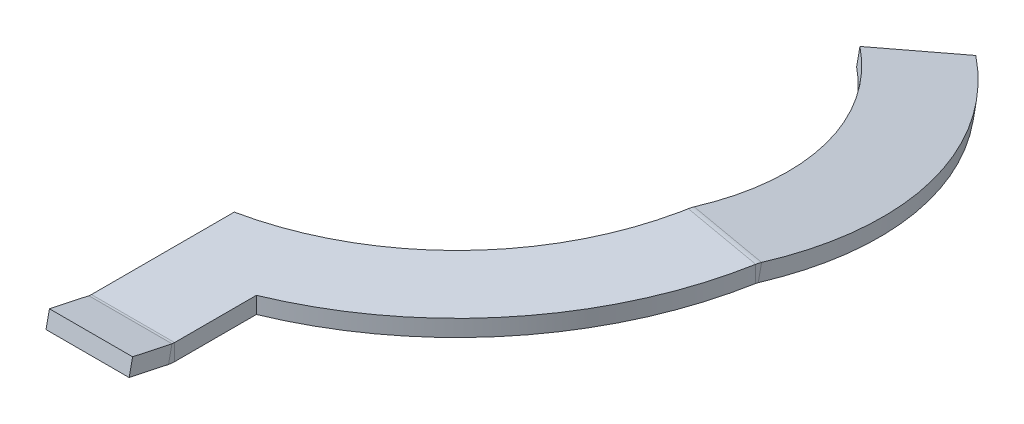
ISO-10303-21;
HEADER;
FILE_DESCRIPTION(('STEP AP214'),'2;1');
FILE_NAME('part.step','',(''),(''),'','','');
FILE_SCHEMA(('AUTOMOTIVE_DESIGN { 1 0 10303 214 1 1 1 1 }'));
ENDSEC;
DATA;
#1=APPLICATION_CONTEXT('core data for automotive mechanical design processes');
#2=APPLICATION_PROTOCOL_DEFINITION('international standard','automotive_design',2000,#1);
#3=PRODUCT_CONTEXT('',#1,'mechanical');
#4=PRODUCT('Part','Part','',(#3));
#5=PRODUCT_RELATED_PRODUCT_CATEGORY('part','',(#4));
#6=PRODUCT_DEFINITION_FORMATION('','',#4);
#7=PRODUCT_DEFINITION_CONTEXT('part definition',#1,'design');
#8=PRODUCT_DEFINITION('design','',#6,#7);
#9=PRODUCT_DEFINITION_SHAPE('','',#8);
#10=(LENGTH_UNIT() NAMED_UNIT(*) SI_UNIT(.MILLI.,.METRE.));
#11=(NAMED_UNIT(*) PLANE_ANGLE_UNIT() SI_UNIT($,.RADIAN.));
#12=(NAMED_UNIT(*) SI_UNIT($,.STERADIAN.) SOLID_ANGLE_UNIT());
#13=UNCERTAINTY_MEASURE_WITH_UNIT(LENGTH_MEASURE(1.E-05),#10,'distance_accuracy_value','');
#14=(GEOMETRIC_REPRESENTATION_CONTEXT(3) GLOBAL_UNCERTAINTY_ASSIGNED_CONTEXT((#13)) GLOBAL_UNIT_ASSIGNED_CONTEXT((#10,
#11,#12)) REPRESENTATION_CONTEXT('',''));
#15=CARTESIAN_POINT('',(0.,0.,0.));
#16=DIRECTION('',(0.,0.,1.));
#17=DIRECTION('',(1.,0.,0.));
#18=AXIS2_PLACEMENT_3D('',#15,#16,#17);
#19=CARTESIAN_POINT('',(0.,4.,0.));
#20=DIRECTION('',(0.,1.,0.));
#21=DIRECTION('',(0.,0.,1.));
#22=AXIS2_PLACEMENT_3D('',#19,#20,#21);
#23=PLANE('',#22);
#24=CARTESIAN_POINT('',(0.,4.,0.));
#25=DIRECTION('',(0.,1.,0.));
#26=DIRECTION('',(0.,0.,1.));
#27=AXIS2_PLACEMENT_3D('',#24,#25,#26);
#28=CIRCLE('',#27,89.);
#29=CARTESIAN_POINT('',(34.,4.,82.2496200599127));
#30=VERTEX_POINT('',#29);
#31=CARTESIAN_POINT('',(87.6019321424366,3.99999999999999,15.7130991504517));
#32=VERTEX_POINT('',#31);
#33=EDGE_CURVE('E306',#30,#32,#28,.T.);
#34=ORIENTED_EDGE('',*,*,#33,.T.);
#35=DIRECTION('',(0.984807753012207,0.,0.173648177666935));
#36=VECTOR('',#35,1.);
#37=CARTESIAN_POINT('',(87.6019321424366,3.99999999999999,15.7130991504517));
#38=LINE('',#37,#36);
#39=CARTESIAN_POINT('',(67.9061582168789,4.,12.2402028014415));
#40=VERTEX_POINT('',#39);
#41=EDGE_CURVE('E184',#32,#40,#38,.F.);
#42=ORIENTED_EDGE('',*,*,#41,.T.);
#43=DIRECTION('',(-0.173648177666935,0.,0.984807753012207));
#44=VECTOR('',#43,1.);
#45=CARTESIAN_POINT('',(67.9517349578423,4.,11.9817242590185));
#46=LINE('',#45,#44);
#47=CARTESIAN_POINT('',(67.5588618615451,4.,14.2098183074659));
#48=VERTEX_POINT('',#47);
#49=EDGE_CURVE('E54',#40,#48,#46,.T.);
#50=ORIENTED_EDGE('',*,*,#49,.T.);
#51=DIRECTION('',(-0.984807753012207,0.,-0.173648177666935));
#52=VECTOR('',#51,1.);
#53=CARTESIAN_POINT('',(-0.392873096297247,4.,2.22809404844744));
#54=LINE('',#53,#52);
#55=CARTESIAN_POINT('',(67.5223231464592,4.,14.2033755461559));
#56=VERTEX_POINT('',#55);
#57=EDGE_CURVE('E229',#48,#56,#54,.T.);
#58=ORIENTED_EDGE('',*,*,#57,.T.);
#59=CARTESIAN_POINT('',(0.,4.,0.));
#60=DIRECTION('',(0.,-1.,0.));
#61=DIRECTION('',(0.,0.,1.));
#62=AXIS2_PLACEMENT_3D('',#59,#60,#61);
#63=CIRCLE('',#62,69.);
#64=CARTESIAN_POINT('',(14.,4.,67.5647837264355));
#65=VERTEX_POINT('',#64);
#66=EDGE_CURVE('E309',#56,#65,#63,.T.);
#67=ORIENTED_EDGE('',*,*,#66,.T.);
#68=DIRECTION('',(0.,0.,1.));
#69=VECTOR('',#68,1.);
#70=CARTESIAN_POINT('',(14.,4.,102.249620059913));
#71=LINE('',#70,#69);
#72=CARTESIAN_POINT('',(14.,4.,101.934307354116));
#73=VERTEX_POINT('',#72);
#74=EDGE_CURVE('E301',#65,#73,#71,.T.);
#75=ORIENTED_EDGE('',*,*,#74,.T.);
#76=DIRECTION('',(1.,0.,0.));
#77=VECTOR('',#76,1.);
#78=CARTESIAN_POINT('',(34.,4.,101.934307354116));
#79=LINE('',#78,#77);
#80=CARTESIAN_POINT('',(34.,4.,101.934307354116));
#81=VERTEX_POINT('',#80);
#82=EDGE_CURVE('E274',#81,#73,#79,.F.);
#83=ORIENTED_EDGE('',*,*,#82,.F.);
#84=DIRECTION('',(0.,0.,-1.));
#85=VECTOR('',#84,1.);
#86=CARTESIAN_POINT('',(34.,4.,102.249620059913));
#87=LINE('',#86,#85);
#88=EDGE_CURVE('E304',#81,#30,#87,.T.);
#89=ORIENTED_EDGE('',*,*,#88,.T.);
#90=EDGE_LOOP('',(#34,#42,#50,#58,#67,#75,#83,#89));
#91=FACE_BOUND('',#90,.T.);
#92=ADVANCED_FACE('F31',(#91),#23,.T.);
#93=CARTESIAN_POINT('',(0.,0.,0.));
#94=DIRECTION('',(0.,1.,0.));
#95=DIRECTION('',(0.,0.,1.));
#96=AXIS2_PLACEMENT_3D('',#93,#94,#95);
#97=PLANE('',#96);
#98=DIRECTION('',(0.984807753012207,0.,0.173648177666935));
#99=VECTOR('',#98,1.);
#100=CARTESIAN_POINT('',(87.6019321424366,0.,15.7130991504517));
#101=LINE('',#100,#99);
#102=CARTESIAN_POINT('',(87.6019321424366,0.,15.7130991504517));
#103=VERTEX_POINT('',#102);
#104=CARTESIAN_POINT('',(67.9061582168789,0.,12.2402028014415));
#105=VERTEX_POINT('',#104);
#106=EDGE_CURVE('E175',#103,#105,#101,.F.);
#107=ORIENTED_EDGE('',*,*,#106,.F.);
#108=CARTESIAN_POINT('',(0.,0.,0.));
#109=DIRECTION('',(0.,1.,0.));
#110=DIRECTION('',(0.,0.,1.));
#111=AXIS2_PLACEMENT_3D('',#108,#109,#110);
#112=CIRCLE('',#111,89.);
#113=CARTESIAN_POINT('',(34.,0.,82.2496200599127));
#114=VERTEX_POINT('',#113);
#115=EDGE_CURVE('E296',#114,#103,#112,.T.);
#116=ORIENTED_EDGE('',*,*,#115,.F.);
#117=DIRECTION('',(0.,0.,-1.));
#118=VECTOR('',#117,1.);
#119=CARTESIAN_POINT('',(34.,0.,102.249620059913));
#120=LINE('',#119,#118);
#121=CARTESIAN_POINT('',(34.,0.,101.934307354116));
#122=VERTEX_POINT('',#121);
#123=EDGE_CURVE('E294',#122,#114,#120,.T.);
#124=ORIENTED_EDGE('',*,*,#123,.F.);
#125=DIRECTION('',(1.,0.,0.));
#126=VECTOR('',#125,1.);
#127=CARTESIAN_POINT('',(34.,0.,101.934307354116));
#128=LINE('',#127,#126);
#129=CARTESIAN_POINT('',(14.,0.,101.934307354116));
#130=VERTEX_POINT('',#129);
#131=EDGE_CURVE('E279',#122,#130,#128,.F.);
#132=ORIENTED_EDGE('',*,*,#131,.T.);
#133=DIRECTION('',(0.,0.,1.));
#134=VECTOR('',#133,1.);
#135=CARTESIAN_POINT('',(14.,0.,102.249620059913));
#136=LINE('',#135,#134);
#137=CARTESIAN_POINT('',(14.,0.,67.5647837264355));
#138=VERTEX_POINT('',#137);
#139=EDGE_CURVE('E290',#138,#130,#136,.T.);
#140=ORIENTED_EDGE('',*,*,#139,.F.);
#141=CARTESIAN_POINT('',(0.,0.,0.));
#142=DIRECTION('',(0.,-1.,0.));
#143=DIRECTION('',(0.,0.,1.));
#144=AXIS2_PLACEMENT_3D('',#141,#142,#143);
#145=CIRCLE('',#144,69.);
#146=CARTESIAN_POINT('',(67.5223231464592,0.,14.2033755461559));
#147=VERTEX_POINT('',#146);
#148=EDGE_CURVE('E299',#147,#138,#145,.T.);
#149=ORIENTED_EDGE('',*,*,#148,.F.);
#150=DIRECTION('',(-0.984807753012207,0.,-0.173648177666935));
#151=VECTOR('',#150,1.);
#152=CARTESIAN_POINT('',(67.5588618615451,0.,14.2098183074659));
#153=LINE('',#152,#151);
#154=CARTESIAN_POINT('',(67.5588618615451,0.,14.2098183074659));
#155=VERTEX_POINT('',#154);
#156=EDGE_CURVE('E230',#155,#147,#153,.T.);
#157=ORIENTED_EDGE('',*,*,#156,.F.);
#158=DIRECTION('',(-0.173648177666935,0.,0.984807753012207));
#159=VECTOR('',#158,1.);
#160=CARTESIAN_POINT('',(67.9061582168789,0.,12.2402028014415));
#161=LINE('',#160,#159);
#162=EDGE_CURVE('E226',#105,#155,#161,.T.);
#163=ORIENTED_EDGE('',*,*,#162,.F.);
#164=EDGE_LOOP('',(#107,#116,#124,#132,#140,#149,#157,#163));
#165=FACE_BOUND('',#164,.T.);
#166=ADVANCED_FACE('F324',(#165),#97,.F.);
#167=CARTESIAN_POINT('',(0.,4.,0.));
#168=DIRECTION('',(0.,-1.,0.));
#169=DIRECTION('',(0.,0.,-1.));
#170=AXIS2_PLACEMENT_3D('',#167,#168,#169);
#171=CYLINDRICAL_SURFACE('',#170,89.);
#172=DIRECTION('',(0.,1.,0.));
#173=VECTOR('',#172,1.);
#174=CARTESIAN_POINT('',(87.6019321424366,0.,15.7130991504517));
#175=LINE('',#174,#173);
#176=EDGE_CURVE('E215',#103,#32,#175,.T.);
#177=ORIENTED_EDGE('',*,*,#176,.T.);
#178=ORIENTED_EDGE('',*,*,#33,.F.);
#179=DIRECTION('',(0.,-1.,0.));
#180=VECTOR('',#179,1.);
#181=CARTESIAN_POINT('',(34.,4.,82.2496200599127));
#182=LINE('',#181,#180);
#183=EDGE_CURVE('E39',#30,#114,#182,.T.);
#184=ORIENTED_EDGE('',*,*,#183,.T.);
#185=ORIENTED_EDGE('',*,*,#115,.T.);
#186=EDGE_LOOP('',(#177,#178,#184,#185));
#187=FACE_BOUND('',#186,.T.);
#188=ADVANCED_FACE('F318',(#187),#171,.T.);
#189=CARTESIAN_POINT('',(0.,4.,0.));
#190=DIRECTION('',(0.,-1.,0.));
#191=DIRECTION('',(0.,0.,-1.));
#192=AXIS2_PLACEMENT_3D('',#189,#190,#191);
#193=CYLINDRICAL_SURFACE('',#192,69.);
#194=DIRECTION('',(0.,-1.,0.));
#195=VECTOR('',#194,1.);
#196=CARTESIAN_POINT('',(67.5223231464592,4.,14.2033755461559));
#197=LINE('',#196,#195);
#198=EDGE_CURVE('E11',#147,#56,#197,.F.);
#199=ORIENTED_EDGE('',*,*,#198,.F.);
#200=ORIENTED_EDGE('',*,*,#148,.T.);
#201=DIRECTION('',(0.,-1.,0.));
#202=VECTOR('',#201,1.);
#203=CARTESIAN_POINT('',(14.,4.,67.5647837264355));
#204=LINE('',#203,#202);
#205=EDGE_CURVE('E311',#65,#138,#204,.T.);
#206=ORIENTED_EDGE('',*,*,#205,.F.);
#207=ORIENTED_EDGE('',*,*,#66,.F.);
#208=EDGE_LOOP('',(#199,#200,#206,#207));
#209=FACE_BOUND('',#208,.T.);
#210=ADVANCED_FACE('F365',(#209),#193,.F.);
#211=CARTESIAN_POINT('',(14.,4.,102.249620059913));
#212=DIRECTION('',(1.,0.,0.));
#213=DIRECTION('',(0.,0.,-1.));
#214=AXIS2_PLACEMENT_3D('',#211,#212,#213);
#215=PLANE('',#214);
#216=DIRECTION('',(0.,-1.,0.));
#217=VECTOR('',#216,1.);
#218=CARTESIAN_POINT('',(14.,4.,101.934307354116));
#219=LINE('',#218,#217);
#220=EDGE_CURVE('E287',#73,#130,#219,.T.);
#221=ORIENTED_EDGE('',*,*,#220,.F.);
#222=ORIENTED_EDGE('',*,*,#74,.F.);
#223=ORIENTED_EDGE('',*,*,#205,.T.);
#224=ORIENTED_EDGE('',*,*,#139,.T.);
#225=EDGE_LOOP('',(#221,#222,#223,#224));
#226=FACE_BOUND('',#225,.T.);
#227=ADVANCED_FACE('F33',(#226),#215,.F.);
#228=CARTESIAN_POINT('',(34.,4.,102.249620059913));
#229=DIRECTION('',(-1.,0.,0.));
#230=DIRECTION('',(0.,0.,1.));
#231=AXIS2_PLACEMENT_3D('',#228,#229,#230);
#232=PLANE('',#231);
#233=DIRECTION('',(0.,-1.,0.));
#234=VECTOR('',#233,1.);
#235=CARTESIAN_POINT('',(34.,4.,101.934307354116));
#236=LINE('',#235,#234);
#237=EDGE_CURVE('E284',#81,#122,#236,.T.);
#238=ORIENTED_EDGE('',*,*,#237,.T.);
#239=ORIENTED_EDGE('',*,*,#123,.T.);
#240=ORIENTED_EDGE('',*,*,#183,.F.);
#241=ORIENTED_EDGE('',*,*,#88,.F.);
#242=EDGE_LOOP('',(#238,#239,#240,#241));
#243=FACE_BOUND('',#242,.T.);
#244=ADVANCED_FACE('F370',(#243),#232,.F.);
#245=CARTESIAN_POINT('',(14.,6.99999999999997,101.934307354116));
#246=DIRECTION('',(-1.,0.,0.));
#247=DIRECTION('',(0.,-1.,0.));
#248=AXIS2_PLACEMENT_3D('',#245,#246,#247);
#249=PLANE('',#248);
#250=DIRECTION('',(0.,-0.978147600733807,0.207911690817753));
#251=VECTOR('',#250,1.);
#252=CARTESIAN_POINT('',(14.,4.06555719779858,102.558042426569));
#253=LINE('',#252,#251);
#254=CARTESIAN_POINT('',(14.,4.06555719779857,102.558042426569));
#255=VERTEX_POINT('',#254);
#256=CARTESIAN_POINT('',(14.,0.152966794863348,103.38968918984));
#257=VERTEX_POINT('',#256);
#258=EDGE_CURVE('E237',#255,#257,#253,.T.);
#259=ORIENTED_EDGE('',*,*,#258,.F.);
#260=CARTESIAN_POINT('',(14.,6.99999999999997,101.934307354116));
#261=DIRECTION('',(1.,0.,0.));
#262=DIRECTION('',(0.,1.,0.));
#263=AXIS2_PLACEMENT_3D('',#260,#261,#262);
#264=CIRCLE('',#263,2.99999999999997);
#265=EDGE_CURVE('E270',#73,#255,#264,.F.);
#266=ORIENTED_EDGE('',*,*,#265,.F.);
#267=ORIENTED_EDGE('',*,*,#220,.T.);
#268=CARTESIAN_POINT('',(14.,6.99999999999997,101.934307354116));
#269=DIRECTION('',(1.,0.,0.));
#270=DIRECTION('',(0.,1.,0.));
#271=AXIS2_PLACEMENT_3D('',#268,#269,#270);
#272=CIRCLE('',#271,6.99999999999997);
#273=EDGE_CURVE('E281',#130,#257,#272,.F.);
#274=ORIENTED_EDGE('',*,*,#273,.T.);
#275=EDGE_LOOP('',(#259,#266,#267,#274));
#276=FACE_BOUND('',#275,.T.);
#277=ADVANCED_FACE('F372',(#276),#249,.T.);
#278=CARTESIAN_POINT('',(34.,6.99999999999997,101.934307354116));
#279=DIRECTION('',(-1.,0.,0.));
#280=DIRECTION('',(0.,-1.,0.));
#281=AXIS2_PLACEMENT_3D('',#278,#279,#280);
#282=PLANE('',#281);
#283=CARTESIAN_POINT('',(34.,6.99999999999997,101.934307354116));
#284=DIRECTION('',(1.,0.,0.));
#285=DIRECTION('',(0.,1.,0.));
#286=AXIS2_PLACEMENT_3D('',#283,#284,#285);
#287=CIRCLE('',#286,2.99999999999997);
#288=CARTESIAN_POINT('',(34.,4.06555719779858,102.558042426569));
#289=VERTEX_POINT('',#288);
#290=EDGE_CURVE('E267',#289,#81,#287,.T.);
#291=ORIENTED_EDGE('',*,*,#290,.F.);
#292=DIRECTION('',(0.,-0.978147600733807,0.207911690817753));
#293=VECTOR('',#292,1.);
#294=CARTESIAN_POINT('',(34.,4.06555719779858,102.558042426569));
#295=LINE('',#294,#293);
#296=CARTESIAN_POINT('',(34.,0.152966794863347,103.38968918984));
#297=VERTEX_POINT('',#296);
#298=EDGE_CURVE('E240',#289,#297,#295,.T.);
#299=ORIENTED_EDGE('',*,*,#298,.T.);
#300=CARTESIAN_POINT('',(34.,6.99999999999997,101.934307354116));
#301=DIRECTION('',(1.,0.,0.));
#302=DIRECTION('',(0.,1.,0.));
#303=AXIS2_PLACEMENT_3D('',#300,#301,#302);
#304=CIRCLE('',#303,6.99999999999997);
#305=EDGE_CURVE('E273',#297,#122,#304,.T.);
#306=ORIENTED_EDGE('',*,*,#305,.T.);
#307=ORIENTED_EDGE('',*,*,#237,.F.);
#308=EDGE_LOOP('',(#291,#299,#306,#307));
#309=FACE_BOUND('',#308,.T.);
#310=ADVANCED_FACE('F377',(#309),#282,.F.);
#311=CARTESIAN_POINT('',(34.,6.99999999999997,101.934307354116));
#312=DIRECTION('',(1.,0.,0.));
#313=DIRECTION('',(0.,-0.978147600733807,0.207911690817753));
#314=AXIS2_PLACEMENT_3D('',#311,#312,#313);
#315=CYLINDRICAL_SURFACE('',#314,6.99999999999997);
#316=ORIENTED_EDGE('',*,*,#131,.F.);
#317=ORIENTED_EDGE('',*,*,#305,.F.);
#318=DIRECTION('',(1.,0.,0.));
#319=VECTOR('',#318,1.);
#320=CARTESIAN_POINT('',(34.,0.152966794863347,103.38968918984));
#321=LINE('',#320,#319);
#322=EDGE_CURVE('E243',#257,#297,#321,.T.);
#323=ORIENTED_EDGE('',*,*,#322,.F.);
#324=ORIENTED_EDGE('',*,*,#273,.F.);
#325=EDGE_LOOP('',(#316,#317,#323,#324));
#326=FACE_BOUND('',#325,.T.);
#327=ADVANCED_FACE('F380',(#326),#315,.T.);
#328=CARTESIAN_POINT('',(34.,6.99999999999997,101.934307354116));
#329=DIRECTION('',(1.,0.,0.));
#330=DIRECTION('',(0.,-0.978147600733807,0.207911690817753));
#331=AXIS2_PLACEMENT_3D('',#328,#329,#330);
#332=CYLINDRICAL_SURFACE('',#331,2.99999999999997);
#333=ORIENTED_EDGE('',*,*,#82,.T.);
#334=ORIENTED_EDGE('',*,*,#265,.T.);
#335=DIRECTION('',(1.,0.,0.));
#336=VECTOR('',#335,1.);
#337=CARTESIAN_POINT('',(14.,4.06555719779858,102.558042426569));
#338=LINE('',#337,#336);
#339=EDGE_CURVE('E238',#255,#289,#338,.T.);
#340=ORIENTED_EDGE('',*,*,#339,.T.);
#341=ORIENTED_EDGE('',*,*,#290,.T.);
#342=EDGE_LOOP('',(#333,#334,#340,#341));
#343=FACE_BOUND('',#342,.T.);
#344=ADVANCED_FACE('F386',(#343),#332,.F.);
#345=CARTESIAN_POINT('',(34.,0.0874095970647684,103.081266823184));
#346=DIRECTION('',(1.,0.,0.));
#347=DIRECTION('',(0.,0.,-1.));
#348=AXIS2_PLACEMENT_3D('',#345,#346,#347);
#349=PLANE('',#348);
#350=DIRECTION('',(0.,-0.207911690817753,-0.978147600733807));
#351=VECTOR('',#350,1.);
#352=CARTESIAN_POINT('',(34.,0.0874095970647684,103.081266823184));
#353=LINE('',#352,#351);
#354=CARTESIAN_POINT('',(34.,2.1665265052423,112.862742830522));
#355=VERTEX_POINT('',#354);
#356=EDGE_CURVE('E261',#355,#297,#353,.T.);
#357=ORIENTED_EDGE('',*,*,#356,.T.);
#358=ORIENTED_EDGE('',*,*,#298,.F.);
#359=DIRECTION('',(0.,-0.207911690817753,-0.978147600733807));
#360=VECTOR('',#359,1.);
#361=CARTESIAN_POINT('',(34.,4.,102.249620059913));
#362=LINE('',#361,#360);
#363=CARTESIAN_POINT('',(34.,6.07911690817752,112.031096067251));
#364=VERTEX_POINT('',#363);
#365=EDGE_CURVE('E253',#364,#289,#362,.T.);
#366=ORIENTED_EDGE('',*,*,#365,.F.);
#367=DIRECTION('',(0.,0.978147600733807,-0.207911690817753));
#368=VECTOR('',#367,1.);
#369=CARTESIAN_POINT('',(34.,2.1665265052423,112.862742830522));
#370=LINE('',#369,#368);
#371=EDGE_CURVE('E265',#355,#364,#370,.T.);
#372=ORIENTED_EDGE('',*,*,#371,.F.);
#373=EDGE_LOOP('',(#357,#358,#366,#372));
#374=FACE_BOUND('',#373,.T.);
#375=ADVANCED_FACE('F403',(#374),#349,.T.);
#376=CARTESIAN_POINT('',(14.,2.1665265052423,112.862742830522));
#377=DIRECTION('',(-1.,0.,0.));
#378=DIRECTION('',(0.,0.,1.));
#379=AXIS2_PLACEMENT_3D('',#376,#377,#378);
#380=PLANE('',#379);
#381=DIRECTION('',(0.,0.207911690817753,0.978147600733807));
#382=VECTOR('',#381,1.);
#383=CARTESIAN_POINT('',(14.,6.07911690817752,112.031096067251));
#384=LINE('',#383,#382);
#385=CARTESIAN_POINT('',(14.,6.07911690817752,112.031096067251));
#386=VERTEX_POINT('',#385);
#387=EDGE_CURVE('E248',#255,#386,#384,.T.);
#388=ORIENTED_EDGE('',*,*,#387,.F.);
#389=ORIENTED_EDGE('',*,*,#258,.T.);
#390=DIRECTION('',(0.,0.207911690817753,0.978147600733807));
#391=VECTOR('',#390,1.);
#392=CARTESIAN_POINT('',(14.,2.1665265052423,112.862742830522));
#393=LINE('',#392,#391);
#394=CARTESIAN_POINT('',(14.,2.1665265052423,112.862742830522));
#395=VERTEX_POINT('',#394);
#396=EDGE_CURVE('E256',#257,#395,#393,.T.);
#397=ORIENTED_EDGE('',*,*,#396,.T.);
#398=DIRECTION('',(0.,0.978147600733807,-0.207911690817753));
#399=VECTOR('',#398,1.);
#400=CARTESIAN_POINT('',(14.,2.1665265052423,112.862742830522));
#401=LINE('',#400,#399);
#402=EDGE_CURVE('E264',#395,#386,#401,.T.);
#403=ORIENTED_EDGE('',*,*,#402,.T.);
#404=EDGE_LOOP('',(#388,#389,#397,#403));
#405=FACE_BOUND('',#404,.T.);
#406=ADVANCED_FACE('F395',(#405),#380,.T.);
#407=CARTESIAN_POINT('',(34.,0.0874095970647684,103.081266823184));
#408=DIRECTION('',(0.,-0.978147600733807,0.207911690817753));
#409=DIRECTION('',(0.,-0.207911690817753,-0.978147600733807));
#410=AXIS2_PLACEMENT_3D('',#407,#408,#409);
#411=PLANE('',#410);
#412=ORIENTED_EDGE('',*,*,#396,.F.);
#413=ORIENTED_EDGE('',*,*,#322,.T.);
#414=ORIENTED_EDGE('',*,*,#356,.F.);
#415=DIRECTION('',(1.,0.,0.));
#416=VECTOR('',#415,1.);
#417=CARTESIAN_POINT('',(34.,2.1665265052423,112.862742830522));
#418=LINE('',#417,#416);
#419=EDGE_CURVE('E258',#395,#355,#418,.T.);
#420=ORIENTED_EDGE('',*,*,#419,.F.);
#421=EDGE_LOOP('',(#412,#413,#414,#420));
#422=FACE_BOUND('',#421,.T.);
#423=ADVANCED_FACE('F406',(#422),#411,.T.);
#424=CARTESIAN_POINT('',(34.,4.,102.249620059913));
#425=DIRECTION('',(0.,-0.978147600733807,0.207911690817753));
#426=DIRECTION('',(0.,-0.207911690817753,-0.978147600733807));
#427=AXIS2_PLACEMENT_3D('',#424,#425,#426);
#428=PLANE('',#427);
#429=ORIENTED_EDGE('',*,*,#339,.F.);
#430=ORIENTED_EDGE('',*,*,#387,.T.);
#431=DIRECTION('',(1.,0.,0.));
#432=VECTOR('',#431,1.);
#433=CARTESIAN_POINT('',(34.,6.07911690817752,112.031096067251));
#434=LINE('',#433,#432);
#435=EDGE_CURVE('E250',#386,#364,#434,.T.);
#436=ORIENTED_EDGE('',*,*,#435,.T.);
#437=ORIENTED_EDGE('',*,*,#365,.T.);
#438=EDGE_LOOP('',(#429,#430,#436,#437));
#439=FACE_BOUND('',#438,.T.);
#440=ADVANCED_FACE('F391',(#439),#428,.F.);
#441=CARTESIAN_POINT('',(34.,2.1665265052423,112.862742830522));
#442=DIRECTION('',(0.,0.207911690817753,0.978147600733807));
#443=DIRECTION('',(0.,-0.978147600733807,0.207911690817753));
#444=AXIS2_PLACEMENT_3D('',#441,#442,#443);
#445=PLANE('',#444);
#446=ORIENTED_EDGE('',*,*,#435,.F.);
#447=ORIENTED_EDGE('',*,*,#402,.F.);
#448=ORIENTED_EDGE('',*,*,#419,.T.);
#449=ORIENTED_EDGE('',*,*,#371,.T.);
#450=EDGE_LOOP('',(#446,#447,#448,#449));
#451=FACE_BOUND('',#450,.T.);
#452=ADVANCED_FACE('F401',(#451),#445,.T.);
#453=CARTESIAN_POINT('',(67.5588618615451,0.,14.2098183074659));
#454=DIRECTION('',(0.173648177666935,0.,-0.984807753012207));
#455=DIRECTION('',(-0.984807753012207,0.,-0.173648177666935));
#456=AXIS2_PLACEMENT_3D('',#453,#454,#455);
#457=PLANE('',#456);
#458=ORIENTED_EDGE('',*,*,#57,.F.);
#459=DIRECTION('',(0.,1.,0.));
#460=VECTOR('',#459,1.);
#461=CARTESIAN_POINT('',(67.5588618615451,0.,14.2098183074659));
#462=LINE('',#461,#460);
#463=EDGE_CURVE('E225',#155,#48,#462,.T.);
#464=ORIENTED_EDGE('',*,*,#463,.F.);
#465=ORIENTED_EDGE('',*,*,#156,.T.);
#466=ORIENTED_EDGE('',*,*,#198,.T.);
#467=EDGE_LOOP('',(#458,#464,#465,#466));
#468=FACE_BOUND('',#467,.T.);
#469=ADVANCED_FACE('F415',(#468),#457,.T.);
#470=CARTESIAN_POINT('',(67.9061582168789,0.,12.2402028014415));
#471=DIRECTION('',(-0.984807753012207,0.,-0.173648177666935));
#472=DIRECTION('',(-0.173648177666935,0.,0.984807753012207));
#473=AXIS2_PLACEMENT_3D('',#470,#471,#472);
#474=PLANE('',#473);
#475=ORIENTED_EDGE('',*,*,#49,.F.);
#476=DIRECTION('',(0.,1.,0.));
#477=VECTOR('',#476,1.);
#478=CARTESIAN_POINT('',(67.9061582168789,0.,12.2402028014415));
#479=LINE('',#478,#477);
#480=EDGE_CURVE('E223',#105,#40,#479,.T.);
#481=ORIENTED_EDGE('',*,*,#480,.F.);
#482=ORIENTED_EDGE('',*,*,#162,.T.);
#483=ORIENTED_EDGE('',*,*,#463,.T.);
#484=EDGE_LOOP('',(#475,#481,#482,#483));
#485=FACE_BOUND('',#484,.T.);
#486=ADVANCED_FACE('F417',(#485),#474,.T.);
#487=CARTESIAN_POINT('',(67.9061582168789,4.04,12.2402028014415));
#488=CARTESIAN_POINT('',(67.9771174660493,4.04,11.8368146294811));
#489=CARTESIAN_POINT('',(68.0480698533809,4.00416970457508,11.4334654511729));
#490=CARTESIAN_POINT('',(68.1179485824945,3.93304658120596,11.0362052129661));
#491=CARTESIAN_POINT('',(67.9061582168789,4.,12.2402028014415));
#492=CARTESIAN_POINT('',(67.9767133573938,4.,11.8391064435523));
#493=CARTESIAN_POINT('',(68.0472616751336,3.96437328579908,11.4380488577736));
#494=CARTESIAN_POINT('',(68.1167424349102,3.89365427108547,11.0430456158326));
#495=CARTESIAN_POINT('',(67.9061582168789,0.,12.2402028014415));
#496=CARTESIAN_POINT('',(67.9363024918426,0.,12.0682878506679));
#497=CARTESIAN_POINT('',(67.9664438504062,-0.0152685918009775,11.8963895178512));
#498=CARTESIAN_POINT('',(67.996127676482,-0.0455767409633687,11.7270859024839));
#499=B_SPLINE_SURFACE_WITH_KNOTS('',1,3,((#487,#488,#489,#490),(#491,#492,#493,#494),(#495,#496,
#497,#498)),.UNSPECIFIED.,.F.,.F.,.F.,(2,1,2),(4,4),(-0.01,0.,1.),(0.,1.),.UNSPECIFIED.);
#500=DIRECTION('',(0.0301536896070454,0.984807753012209,-0.171010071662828));
#501=VECTOR('',#500,1.);
#502=CARTESIAN_POINT('',(67.996127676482,-0.0455767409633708,11.7270859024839));
#503=LINE('',#502,#501);
#504=CARTESIAN_POINT('',(67.996127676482,-0.045576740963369,11.7270859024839));
#505=VERTEX_POINT('',#504);
#506=CARTESIAN_POINT('',(68.1167424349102,3.89365427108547,11.0430456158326));
#507=VERTEX_POINT('',#506);
#508=EDGE_CURVE('E332',#505,#507,#503,.T.);
#509=CARTESIAN_POINT('',(67.9061582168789,0.,12.2402028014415));
#510=CARTESIAN_POINT('',(67.9099261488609,4.06519692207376E-08,12.2187140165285));
#511=CARTESIAN_POINT('',(67.9136940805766,-0.000237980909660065,12.1972252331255));
#512=CARTESIAN_POINT('',(67.9212281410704,-0.00118985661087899,12.1542578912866));
#513=CARTESIAN_POINT('',(67.9249942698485,-0.00190371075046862,12.1327793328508));
#514=CARTESIAN_POINT('',(67.932522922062,-0.00380695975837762,12.0898426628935));
#515=CARTESIAN_POINT('',(67.9362854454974,-0.00499635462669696,12.0683845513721));
#516=CARTESIAN_POINT('',(67.9438050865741,-0.00785010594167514,12.0254989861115));
#517=CARTESIAN_POINT('',(67.9475622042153,-0.00951446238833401,12.0040715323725));
#518=CARTESIAN_POINT('',(67.9550692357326,-0.0133173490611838,11.9612574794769));
#519=CARTESIAN_POINT('',(67.9588191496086,-0.0154558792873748,11.9398708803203));
#520=CARTESIAN_POINT('',(67.9663099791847,-0.0202060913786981,11.8971487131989));
#521=CARTESIAN_POINT('',(67.9700508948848,-0.0228177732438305,11.875813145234));
#522=CARTESIAN_POINT('',(67.9775219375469,-0.0285130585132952,11.8332031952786));
#523=CARTESIAN_POINT('',(67.9812520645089,-0.0315966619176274,11.8119288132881));
#524=CARTESIAN_POINT('',(67.9886997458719,-0.0382342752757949,11.7694513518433));
#525=CARTESIAN_POINT('',(67.9924173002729,-0.0417882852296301,11.748248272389));
#526=CARTESIAN_POINT('',(67.996127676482,-0.0455767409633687,11.7270859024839));
#527=B_SPLINE_CURVE_WITH_KNOTS('',3,(#509,#510,#511,#512,#513,#514,#515,#516,#517,#518,#519,
#520,#521,#522,#523,#524,#525,#526),.UNSPECIFIED.,.F.,.F.,(4,2,2,2,2,2,2,2,4),(0.,
0.0654485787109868,0.130897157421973,0.196345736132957,0.261794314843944,0.327242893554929,
0.392691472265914,0.458140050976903,0.523588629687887),.UNSPECIFIED.);
#528=EDGE_CURVE('E185',#105,#505,#527,.T.);
#529=CARTESIAN_POINT('',(67.9061582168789,4.,12.2402028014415));
#530=CARTESIAN_POINT('',(67.9149773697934,4.00000009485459,12.1900671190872));
#531=CARTESIAN_POINT('',(67.9237965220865,3.99944471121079,12.1399314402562));
#532=CARTESIAN_POINT('',(67.9414306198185,3.99722366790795,12.0396839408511));
#533=CARTESIAN_POINT('',(67.9502455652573,3.9955580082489,11.9895721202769));
#534=CARTESIAN_POINT('',(67.9678670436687,3.99111709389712,11.8893961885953));
#535=CARTESIAN_POINT('',(67.9766735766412,3.98834183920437,11.8393320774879));
#536=CARTESIAN_POINT('',(67.9942740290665,3.98168308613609,11.7392753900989));
#537=CARTESIAN_POINT('',(68.0030679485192,3.97779958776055,11.6892828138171));
#538=CARTESIAN_POINT('',(68.0206389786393,3.9689261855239,11.5893929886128));
#539=CARTESIAN_POINT('',(68.0294160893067,3.96393628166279,11.5394957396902));
#540=CARTESIAN_POINT('',(68.0469493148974,3.9528524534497,11.4398203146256));
#541=CARTESIAN_POINT('',(68.0557054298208,3.94675852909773,11.3900421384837));
#542=CARTESIAN_POINT('',(68.0731924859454,3.93346953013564,11.2906285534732));
#543=CARTESIAN_POINT('',(68.0819234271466,3.92627445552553,11.2409931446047));
#544=CARTESIAN_POINT('',(68.0993559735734,3.91078669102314,11.1418886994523));
#545=CARTESIAN_POINT('',(68.108057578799,3.90249400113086,11.0924196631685));
#546=CARTESIAN_POINT('',(68.1167424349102,3.89365427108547,11.0430456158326));
#547=B_SPLINE_CURVE_WITH_KNOTS('',3,(#529,#530,#531,#532,#533,#534,#535,#536,#537,#538,#539,
#540,#541,#542,#543,#544,#545,#546),.UNSPECIFIED.,.F.,.F.,(4,2,2,2,2,2,2,2,4),(0.,
0.152713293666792,0.305426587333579,0.458139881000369,0.610853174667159,0.76356646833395,
0.91627976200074,1.06899305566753,1.22170634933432),.UNSPECIFIED.);
#548=EDGE_CURVE('E46',#40,#507,#547,.T.);
#549=ORIENTED_EDGE('',*,*,#508,.F.);
#550=ORIENTED_EDGE('',*,*,#528,.F.);
#551=ORIENTED_EDGE('',*,*,#480,.T.);
#552=ORIENTED_EDGE('',*,*,#548,.T.);
#553=EDGE_LOOP('',(#549,#550,#551,#552));
#554=FACE_BOUND('',#553,.T.);
#555=ADVANCED_FACE('F209',(#554),#499,.F.);
#556=CARTESIAN_POINT('',(87.6019321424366,-3.00000000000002,15.7130991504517));
#557=DIRECTION('',(-0.984807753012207,0.,-0.173648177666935));
#558=DIRECTION('',(-0.173648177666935,0.,0.984807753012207));
#559=AXIS2_PLACEMENT_3D('',#556,#557,#558);
#560=PLANE('',#559);
#561=CARTESIAN_POINT('',(87.6019321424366,-3.00000000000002,15.7130991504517));
#562=DIRECTION('',(0.984807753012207,0.,0.173648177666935));
#563=DIRECTION('',(0.173648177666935,0.,-0.984807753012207));
#564=AXIS2_PLACEMENT_3D('',#561,#562,#563);
#565=CIRCLE('',#564,3.00000000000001);
#566=CARTESIAN_POINT('',(87.6923932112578,-0.0455767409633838,15.2000689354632));
#567=VERTEX_POINT('',#566);
#568=EDGE_CURVE('E171',#567,#103,#565,.T.);
#569=ORIENTED_EDGE('',*,*,#568,.F.);
#570=DIRECTION('',(0.0301536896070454,0.984807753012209,-0.171010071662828));
#571=VECTOR('',#570,1.);
#572=CARTESIAN_POINT('',(87.6923932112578,-0.0455767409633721,15.2000689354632));
#573=LINE('',#572,#571);
#574=CARTESIAN_POINT('',(87.813007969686,3.89365427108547,14.5160286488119));
#575=VERTEX_POINT('',#574);
#576=EDGE_CURVE('E154',#567,#575,#573,.T.);
#577=ORIENTED_EDGE('',*,*,#576,.T.);
#578=CARTESIAN_POINT('',(87.6019321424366,-3.00000000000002,15.7130991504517));
#579=DIRECTION('',(0.984807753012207,0.,0.173648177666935));
#580=DIRECTION('',(0.173648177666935,0.,-0.984807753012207));
#581=AXIS2_PLACEMENT_3D('',#578,#579,#580);
#582=CIRCLE('',#581,7.00000000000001);
#583=EDGE_CURVE('E181',#575,#32,#582,.T.);
#584=ORIENTED_EDGE('',*,*,#583,.T.);
#585=ORIENTED_EDGE('',*,*,#176,.F.);
#586=EDGE_LOOP('',(#569,#577,#584,#585));
#587=FACE_BOUND('',#586,.T.);
#588=ADVANCED_FACE('F204',(#587),#560,.F.);
#589=CARTESIAN_POINT('',(87.6019321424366,-3.00000000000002,15.7130991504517));
#590=DIRECTION('',(0.984807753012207,0.,0.173648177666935));
#591=DIRECTION('',(0.0301536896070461,0.984807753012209,-0.171010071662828));
#592=AXIS2_PLACEMENT_3D('',#589,#590,#591);
#593=CYLINDRICAL_SURFACE('',#592,7.00000000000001);
#594=ORIENTED_EDGE('',*,*,#41,.F.);
#595=ORIENTED_EDGE('',*,*,#583,.F.);
#596=DIRECTION('',(0.984807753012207,0.,0.173648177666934));
#597=VECTOR('',#596,1.);
#598=CARTESIAN_POINT('',(0.165499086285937,3.89365427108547,-0.938591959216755));
#599=LINE('',#598,#597);
#600=EDGE_CURVE('E158',#507,#575,#599,.T.);
#601=ORIENTED_EDGE('',*,*,#600,.F.);
#602=ORIENTED_EDGE('',*,*,#548,.F.);
#603=EDGE_LOOP('',(#594,#595,#601,#602));
#604=FACE_BOUND('',#603,.T.);
#605=ADVANCED_FACE('F202',(#604),#593,.T.);
#606=CARTESIAN_POINT('',(87.6019321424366,-3.00000000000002,15.7130991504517));
#607=DIRECTION('',(0.984807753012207,0.,0.173648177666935));
#608=DIRECTION('',(0.0301536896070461,0.984807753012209,-0.171010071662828));
#609=AXIS2_PLACEMENT_3D('',#606,#607,#608);
#610=CYLINDRICAL_SURFACE('',#609,3.00000000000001);
#611=ORIENTED_EDGE('',*,*,#106,.T.);
#612=ORIENTED_EDGE('',*,*,#528,.T.);
#613=DIRECTION('',(0.984807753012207,0.,0.173648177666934));
#614=VECTOR('',#613,1.);
#615=CARTESIAN_POINT('',(67.996127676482,-0.0455767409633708,11.7270859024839));
#616=LINE('',#615,#614);
#617=EDGE_CURVE('E336',#505,#567,#616,.T.);
#618=ORIENTED_EDGE('',*,*,#617,.T.);
#619=ORIENTED_EDGE('',*,*,#568,.T.);
#620=EDGE_LOOP('',(#611,#612,#618,#619));
#621=FACE_BOUND('',#620,.T.);
#622=ADVANCED_FACE('F192',(#621),#610,.F.);
#623=CARTESIAN_POINT('',(0.120614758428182,3.93923101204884,-0.684040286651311));
#624=DIRECTION('',(-0.0301536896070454,-0.984807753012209,0.171010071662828));
#625=DIRECTION('',(0.,-0.171087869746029,-0.985255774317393));
#626=AXIS2_PLACEMENT_3D('',#623,#624,#625);
#627=CYLINDRICAL_SURFACE('',#626,89.);
#628=ORIENTED_EDGE('',*,*,#576,.F.);
#629=CARTESIAN_POINT('',(0.,0.,0.));
#630=DIRECTION('',(0.0301536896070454,0.984807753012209,-0.171010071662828));
#631=DIRECTION('',(0.,0.171087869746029,0.985255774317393));
#632=AXIS2_PLACEMENT_3D('',#629,#630,#631);
#633=CIRCLE('',#632,89.);
#634=CARTESIAN_POINT('',(57.0047619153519,-13.3841522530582,-67.0247833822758));
#635=VERTEX_POINT('',#634);
#636=EDGE_CURVE('E147',#567,#635,#633,.T.);
#637=ORIENTED_EDGE('',*,*,#636,.T.);
#638=DIRECTION('',(-0.0301536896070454,-0.984807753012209,0.171010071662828));
#639=VECTOR('',#638,1.);
#640=CARTESIAN_POINT('',(57.1253766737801,-9.44492124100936,-67.7088236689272));
#641=LINE('',#640,#639);
#642=CARTESIAN_POINT('',(57.1253766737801,-9.44492124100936,-67.7088236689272));
#643=VERTEX_POINT('',#642);
#644=EDGE_CURVE('E152',#643,#635,#641,.T.);
#645=ORIENTED_EDGE('',*,*,#644,.F.);
#646=CARTESIAN_POINT('',(0.120614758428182,3.93923101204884,-0.684040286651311));
#647=DIRECTION('',(0.0301536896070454,0.984807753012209,-0.171010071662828));
#648=DIRECTION('',(0.,0.171087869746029,0.985255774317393));
#649=AXIS2_PLACEMENT_3D('',#646,#647,#648);
#650=CIRCLE('',#649,89.);
#651=EDGE_CURVE('E344',#575,#643,#650,.T.);
#652=ORIENTED_EDGE('',*,*,#651,.F.);
#653=EDGE_LOOP('',(#628,#637,#645,#652));
#654=FACE_BOUND('',#653,.T.);
#655=ADVANCED_FACE('F149',(#654),#627,.T.);
#656=CARTESIAN_POINT('',(0.120614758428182,3.93923101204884,-0.684040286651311));
#657=DIRECTION('',(-0.0301536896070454,-0.984807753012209,0.171010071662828));
#658=DIRECTION('',(0.,-0.171087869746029,-0.985255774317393));
#659=AXIS2_PLACEMENT_3D('',#656,#657,#658);
#660=CYLINDRICAL_SURFACE('',#659,69.);
#661=ORIENTED_EDGE('',*,*,#508,.T.);
#662=CARTESIAN_POINT('',(0.120614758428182,3.93923101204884,-0.684040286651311));
#663=DIRECTION('',(-0.0301536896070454,-0.984807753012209,0.171010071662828));
#664=DIRECTION('',(0.,0.171087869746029,0.985255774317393));
#665=AXIS2_PLACEMENT_3D('',#662,#663,#664);
#666=CIRCLE('',#665,69.);
#667=CARTESIAN_POINT('',(44.3153178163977,-6.43724657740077,-52.6470745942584));
#668=VERTEX_POINT('',#667);
#669=EDGE_CURVE('E177',#668,#507,#666,.T.);
#670=ORIENTED_EDGE('',*,*,#669,.F.);
#671=DIRECTION('',(-0.0301536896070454,-0.984807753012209,0.171010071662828));
#672=VECTOR('',#671,1.);
#673=CARTESIAN_POINT('',(44.3153178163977,-6.43724657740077,-52.6470745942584));
#674=LINE('',#673,#672);
#675=CARTESIAN_POINT('',(44.1947030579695,-10.3764775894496,-51.9630343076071));
#676=VERTEX_POINT('',#675);
#677=EDGE_CURVE('E172',#668,#676,#674,.T.);
#678=ORIENTED_EDGE('',*,*,#677,.T.);
#679=CARTESIAN_POINT('',(0.,0.,0.));
#680=DIRECTION('',(-0.0301536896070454,-0.984807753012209,0.171010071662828));
#681=DIRECTION('',(0.,0.171087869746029,0.985255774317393));
#682=AXIS2_PLACEMENT_3D('',#679,#680,#681);
#683=CIRCLE('',#682,69.);
#684=EDGE_CURVE('E163',#676,#505,#683,.T.);
#685=ORIENTED_EDGE('',*,*,#684,.T.);
#686=EDGE_LOOP('',(#661,#670,#678,#685));
#687=FACE_BOUND('',#686,.T.);
#688=ADVANCED_FACE('F348',(#687),#660,.F.);
#689=CARTESIAN_POINT('',(0.120614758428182,3.93923101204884,-0.684040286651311));
#690=DIRECTION('',(0.0301536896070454,0.984807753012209,-0.171010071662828));
#691=DIRECTION('',(0.,0.171087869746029,0.985255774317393));
#692=AXIS2_PLACEMENT_3D('',#689,#690,#691);
#693=PLANE('',#692);
#694=ORIENTED_EDGE('',*,*,#669,.T.);
#695=ORIENTED_EDGE('',*,*,#600,.T.);
#696=ORIENTED_EDGE('',*,*,#651,.T.);
#697=DIRECTION('',(-0.640502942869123,0.150383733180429,0.753087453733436));
#698=VECTOR('',#697,1.);
#699=CARTESIAN_POINT('',(44.3153178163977,-6.43724657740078,-52.6470745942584));
#700=LINE('',#699,#698);
#701=EDGE_CURVE('E170',#643,#668,#700,.T.);
#702=ORIENTED_EDGE('',*,*,#701,.T.);
#703=EDGE_LOOP('',(#694,#695,#696,#702));
#704=FACE_BOUND('',#703,.T.);
#705=ADVANCED_FACE('F347',(#704),#693,.T.);
#706=CARTESIAN_POINT('',(0.,0.,0.));
#707=DIRECTION('',(0.0301536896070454,0.984807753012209,-0.171010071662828));
#708=DIRECTION('',(0.,0.171087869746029,0.985255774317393));
#709=AXIS2_PLACEMENT_3D('',#706,#707,#708);
#710=PLANE('',#709);
#711=ORIENTED_EDGE('',*,*,#617,.F.);
#712=ORIENTED_EDGE('',*,*,#684,.F.);
#713=DIRECTION('',(-0.640502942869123,0.150383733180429,0.753087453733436));
#714=VECTOR('',#713,1.);
#715=CARTESIAN_POINT('',(44.1947030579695,-10.3764775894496,-51.9630343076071));
#716=LINE('',#715,#714);
#717=EDGE_CURVE('E157',#635,#676,#716,.T.);
#718=ORIENTED_EDGE('',*,*,#717,.F.);
#719=ORIENTED_EDGE('',*,*,#636,.F.);
#720=EDGE_LOOP('',(#711,#712,#718,#719));
#721=FACE_BOUND('',#720,.T.);
#722=ADVANCED_FACE('F161',(#721),#710,.F.);
#723=CARTESIAN_POINT('',(44.3153178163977,-6.43724657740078,-52.6470745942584));
#724=DIRECTION('',(0.76736349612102,0.0868240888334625,0.63530688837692));
#725=DIRECTION('',(0.637715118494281,0.,-0.770272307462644));
#726=AXIS2_PLACEMENT_3D('',#723,#724,#725);
#727=PLANE('',#726);
#728=ORIENTED_EDGE('',*,*,#717,.T.);
#729=ORIENTED_EDGE('',*,*,#677,.F.);
#730=ORIENTED_EDGE('',*,*,#701,.F.);
#731=ORIENTED_EDGE('',*,*,#644,.T.);
#732=EDGE_LOOP('',(#728,#729,#730,#731));
#733=FACE_BOUND('',#732,.T.);
#734=ADVANCED_FACE('F169',(#733),#727,.F.);
#735=CLOSED_SHELL('',(#92,#166,#188,#210,#227,#244,#277,#310,#327,#344,#375,#406,#423,#440,#452,
#469,#486,#555,#588,#605,#622,#655,#688,#705,#722,#734));
#736=MANIFOLD_SOLID_BREP('B2',#735);
#737=ADVANCED_BREP_SHAPE_REPRESENTATION('',(#18,#736),#14);
#738=SHAPE_DEFINITION_REPRESENTATION(#9,#737);
ENDSEC;
END-ISO-10303-21;
